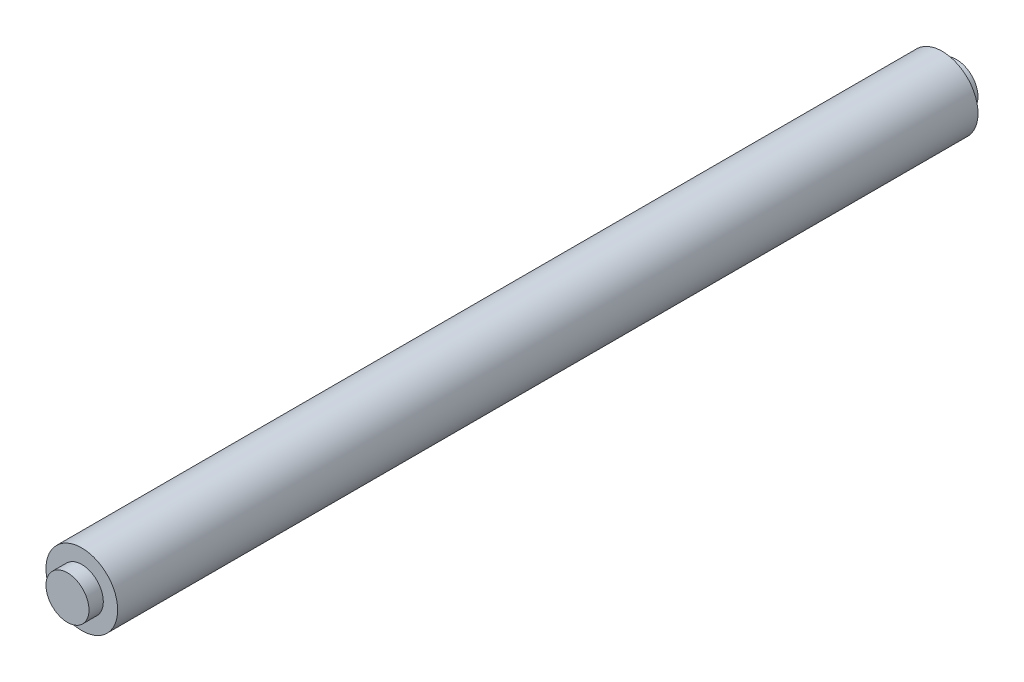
from build123d import *

# Parameters (mm, degrees)
CROQUIS1_R              = 25
SALIENTE_EXTRUIR1_DEPTH = 600
CROQUIS2_R              = 15
SALIENTE_EXTRUIR2_DEPTH = 10
SALIENTE_EXTRUIR3_START = 10
CROQUIS3_R              = 15
SALIENTE_EXTRUIR3_DEPTH = 10


with BuildPart() as part:
    # Croquis1 → Saliente-Extruir1 (new body)
    with BuildSketch(Plane.XY):
        Circle(CROQUIS1_R)
    extrude(amount=SALIENTE_EXTRUIR1_DEPTH)

    # Croquis2 → Saliente-Extruir2 (add)
    with BuildSketch(Plane.XY.offset(600)):
        Circle(CROQUIS2_R)
    extrude(amount=SALIENTE_EXTRUIR2_DEPTH)

    # Croquis3 → Saliente-Extruir3 (add)
    with BuildSketch(Plane(origin=(0, 0, 0), x_dir=(-1, 0, 0), z_dir=(0, 0, -1)).offset(SALIENTE_EXTRUIR3_START)):
        with Locations(Location((0, 0, 0), (0, 0, 180))):
            Circle(CROQUIS3_R)
    extrude(amount=-SALIENTE_EXTRUIR3_DEPTH)


solid = part.part
